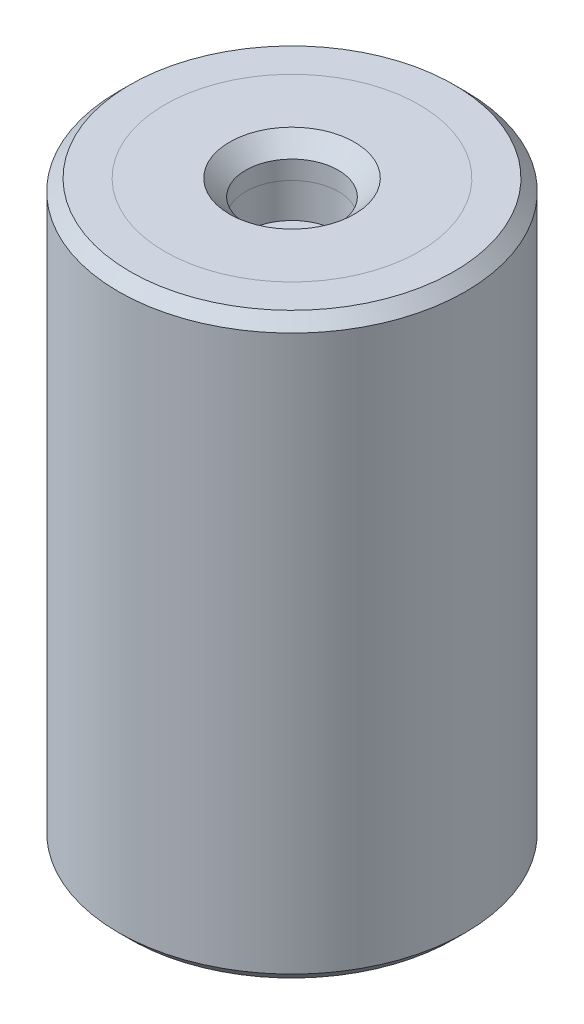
ISO-10303-21;
HEADER;
FILE_DESCRIPTION(('STEP AP214'),'2;1');
FILE_NAME('part.step','',(''),(''),'','','');
FILE_SCHEMA(('AUTOMOTIVE_DESIGN { 1 0 10303 214 1 1 1 1 }'));
ENDSEC;
DATA;
#1=APPLICATION_CONTEXT('core data for automotive mechanical design processes');
#2=APPLICATION_PROTOCOL_DEFINITION('international standard','automotive_design',2000,#1);
#3=PRODUCT_CONTEXT('',#1,'mechanical');
#4=PRODUCT('Part','Part','',(#3));
#5=PRODUCT_RELATED_PRODUCT_CATEGORY('part','',(#4));
#6=PRODUCT_DEFINITION_FORMATION('','',#4);
#7=PRODUCT_DEFINITION_CONTEXT('part definition',#1,'design');
#8=PRODUCT_DEFINITION('design','',#6,#7);
#9=PRODUCT_DEFINITION_SHAPE('','',#8);
#10=(LENGTH_UNIT() NAMED_UNIT(*) SI_UNIT(.MILLI.,.METRE.));
#11=(NAMED_UNIT(*) PLANE_ANGLE_UNIT() SI_UNIT($,.RADIAN.));
#12=(NAMED_UNIT(*) SI_UNIT($,.STERADIAN.) SOLID_ANGLE_UNIT());
#13=UNCERTAINTY_MEASURE_WITH_UNIT(LENGTH_MEASURE(1.E-05),#10,'distance_accuracy_value','');
#14=(GEOMETRIC_REPRESENTATION_CONTEXT(3) GLOBAL_UNCERTAINTY_ASSIGNED_CONTEXT((#13)) GLOBAL_UNIT_ASSIGNED_CONTEXT((#10,
#11,#12)) REPRESENTATION_CONTEXT('',''));
#15=CARTESIAN_POINT('',(0.,0.,0.));
#16=DIRECTION('',(0.,0.,1.));
#17=DIRECTION('',(1.,0.,0.));
#18=AXIS2_PLACEMENT_3D('',#15,#16,#17);
#19=CARTESIAN_POINT('',(0.,46.0340428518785,0.));
#20=DIRECTION('',(0.,1.,0.));
#21=DIRECTION('',(0.,0.,1.));
#22=AXIS2_PLACEMENT_3D('',#19,#20,#21);
#23=CYLINDRICAL_SURFACE('',#22,2.);
#24=CARTESIAN_POINT('',(0.,-22.8,0.));
#25=DIRECTION('',(0.,-1.,0.));
#26=DIRECTION('',(0.,0.,-1.));
#27=AXIS2_PLACEMENT_3D('',#24,#25,#26);
#28=CIRCLE('',#27,2.);
#29=CARTESIAN_POINT('',(0.,-22.8,-2.));
#30=VERTEX_POINT('',#29);
#31=EDGE_CURVE('P0_E10',#30,#30,#28,.T.);
#32=ORIENTED_EDGE('',*,*,#31,.T.);
#33=EDGE_LOOP('',(#32));
#34=FACE_BOUND('',#33,.T.);
#35=CARTESIAN_POINT('',(0.,-22.,0.));
#36=DIRECTION('',(0.,1.,0.));
#37=DIRECTION('',(0.,0.,1.));
#38=AXIS2_PLACEMENT_3D('',#35,#36,#37);
#39=CIRCLE('',#38,2.);
#40=CARTESIAN_POINT('',(0.,-22.,2.));
#41=VERTEX_POINT('',#40);
#42=EDGE_CURVE('P0_E25',#41,#41,#39,.T.);
#43=ORIENTED_EDGE('',*,*,#42,.T.);
#44=EDGE_LOOP('',(#43));
#45=FACE_BOUND('',#44,.T.);
#46=ADVANCED_FACE('P0_F14',(#34,#45),#23,.F.);
#47=CARTESIAN_POINT('',(0.,-22.,2.));
#48=DIRECTION('',(0.,1.,0.));
#49=DIRECTION('',(0.,0.,1.));
#50=AXIS2_PLACEMENT_3D('',#47,#48,#49);
#51=PLANE('',#50);
#52=CARTESIAN_POINT('',(0.,-22.,0.));
#53=DIRECTION('',(0.,1.,0.));
#54=DIRECTION('',(0.,0.,1.));
#55=AXIS2_PLACEMENT_3D('',#52,#53,#54);
#56=CIRCLE('',#55,5.5);
#57=CARTESIAN_POINT('',(0.,-22.,5.5));
#58=VERTEX_POINT('',#57);
#59=EDGE_CURVE('P0_E29',#58,#58,#56,.T.);
#60=ORIENTED_EDGE('',*,*,#59,.T.);
#61=EDGE_LOOP('',(#60));
#62=FACE_BOUND('',#61,.T.);
#63=ORIENTED_EDGE('',*,*,#42,.F.);
#64=EDGE_LOOP('',(#63));
#65=FACE_BOUND('',#64,.T.);
#66=ADVANCED_FACE('P0_F50',(#62,#65),#51,.T.);
#67=CARTESIAN_POINT('',(0.,46.0340428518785,0.));
#68=DIRECTION('',(0.,1.,0.));
#69=DIRECTION('',(0.,0.,1.));
#70=AXIS2_PLACEMENT_3D('',#67,#68,#69);
#71=CYLINDRICAL_SURFACE('',#70,5.5);
#72=CARTESIAN_POINT('',(0.,-23.5,0.));
#73=DIRECTION('',(0.,1.,0.));
#74=DIRECTION('',(0.,0.,1.));
#75=AXIS2_PLACEMENT_3D('',#72,#73,#74);
#76=CIRCLE('',#75,5.5);
#77=CARTESIAN_POINT('',(0.,-23.5,5.5));
#78=VERTEX_POINT('',#77);
#79=EDGE_CURVE('P0_E34',#78,#78,#76,.T.);
#80=ORIENTED_EDGE('',*,*,#79,.T.);
#81=EDGE_LOOP('',(#80));
#82=FACE_BOUND('',#81,.T.);
#83=ORIENTED_EDGE('',*,*,#59,.F.);
#84=EDGE_LOOP('',(#83));
#85=FACE_BOUND('',#84,.T.);
#86=ADVANCED_FACE('P0_F38',(#82,#85),#71,.T.);
#87=CARTESIAN_POINT('',(0.,-23.5,5.5));
#88=DIRECTION('',(0.,-1.,0.));
#89=DIRECTION('',(0.,0.,-1.));
#90=AXIS2_PLACEMENT_3D('',#87,#88,#89);
#91=PLANE('',#90);
#92=CARTESIAN_POINT('',(0.,-23.5,0.));
#93=DIRECTION('',(0.,-1.,0.));
#94=DIRECTION('',(0.,0.,-1.));
#95=AXIS2_PLACEMENT_3D('',#92,#93,#94);
#96=CIRCLE('',#95,2.7);
#97=CARTESIAN_POINT('',(0.,-23.5,-2.7));
#98=VERTEX_POINT('',#97);
#99=EDGE_CURVE('P0_E21',#98,#98,#96,.F.);
#100=ORIENTED_EDGE('',*,*,#99,.T.);
#101=EDGE_LOOP('',(#100));
#102=FACE_BOUND('',#101,.T.);
#103=ORIENTED_EDGE('',*,*,#79,.F.);
#104=EDGE_LOOP('',(#103));
#105=FACE_BOUND('',#104,.T.);
#106=ADVANCED_FACE('P0_F41',(#102,#105),#91,.T.);
#107=CARTESIAN_POINT('',(0.,-23.5,0.));
#108=DIRECTION('',(0.,-1.,0.));
#109=DIRECTION('',(0.,0.,-1.));
#110=AXIS2_PLACEMENT_3D('',#107,#108,#109);
#111=CONICAL_SURFACE('',#110,2.7,0.785398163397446);
#112=ORIENTED_EDGE('',*,*,#31,.F.);
#113=EDGE_LOOP('',(#112));
#114=FACE_BOUND('',#113,.T.);
#115=ORIENTED_EDGE('',*,*,#99,.F.);
#116=EDGE_LOOP('',(#115));
#117=FACE_BOUND('',#116,.T.);
#118=ADVANCED_FACE('P0_F16',(#114,#117),#111,.F.);
#119=CLOSED_SHELL('',(#46,#66,#86,#106,#118));
#120=MANIFOLD_SOLID_BREP('P0_B1',#119);
#121=CARTESIAN_POINT('',(0.,69.5340428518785,0.));
#122=DIRECTION('',(0.,1.,0.));
#123=DIRECTION('',(0.,0.,1.));
#124=AXIS2_PLACEMENT_3D('',#121,#122,#123);
#125=CYLINDRICAL_SURFACE('',#124,2.);
#126=CARTESIAN_POINT('',(0.,0.800000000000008,0.));
#127=DIRECTION('',(0.,1.,0.));
#128=DIRECTION('',(0.,0.,1.));
#129=AXIS2_PLACEMENT_3D('',#126,#127,#128);
#130=CIRCLE('',#129,2.);
#131=CARTESIAN_POINT('',(0.,0.800000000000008,2.));
#132=VERTEX_POINT('',#131);
#133=EDGE_CURVE('P1_E21',#132,#132,#130,.T.);
#134=ORIENTED_EDGE('',*,*,#133,.T.);
#135=EDGE_LOOP('',(#134));
#136=FACE_BOUND('',#135,.T.);
#137=CARTESIAN_POINT('',(0.,0.,0.));
#138=DIRECTION('',(0.,1.,0.));
#139=DIRECTION('',(0.,0.,1.));
#140=AXIS2_PLACEMENT_3D('',#137,#138,#139);
#141=CIRCLE('',#140,2.);
#142=CARTESIAN_POINT('',(0.,0.,2.));
#143=VERTEX_POINT('',#142);
#144=EDGE_CURVE('P1_E34',#143,#143,#141,.T.);
#145=ORIENTED_EDGE('',*,*,#144,.F.);
#146=EDGE_LOOP('',(#145));
#147=FACE_BOUND('',#146,.T.);
#148=ADVANCED_FACE('P1_F14',(#136,#147),#125,.F.);
#149=CARTESIAN_POINT('',(0.,1.5,2.));
#150=DIRECTION('',(0.,1.,0.));
#151=DIRECTION('',(0.,0.,1.));
#152=AXIS2_PLACEMENT_3D('',#149,#150,#151);
#153=PLANE('',#152);
#154=CARTESIAN_POINT('',(0.,1.5,0.));
#155=DIRECTION('',(0.,1.,0.));
#156=DIRECTION('',(0.,0.,1.));
#157=AXIS2_PLACEMENT_3D('',#154,#155,#156);
#158=CIRCLE('',#157,2.7);
#159=CARTESIAN_POINT('',(0.,1.5,2.7));
#160=VERTEX_POINT('',#159);
#161=EDGE_CURVE('P1_E10',#160,#160,#158,.F.);
#162=ORIENTED_EDGE('',*,*,#161,.T.);
#163=EDGE_LOOP('',(#162));
#164=FACE_BOUND('',#163,.T.);
#165=CARTESIAN_POINT('',(0.,1.5,0.));
#166=DIRECTION('',(0.,1.,0.));
#167=DIRECTION('',(0.,0.,1.));
#168=AXIS2_PLACEMENT_3D('',#165,#166,#167);
#169=CIRCLE('',#168,5.5);
#170=CARTESIAN_POINT('',(0.,1.5,5.5));
#171=VERTEX_POINT('',#170);
#172=EDGE_CURVE('P1_E25',#171,#171,#169,.T.);
#173=ORIENTED_EDGE('',*,*,#172,.T.);
#174=EDGE_LOOP('',(#173));
#175=FACE_BOUND('',#174,.T.);
#176=ADVANCED_FACE('P1_F42',(#164,#175),#153,.T.);
#177=CARTESIAN_POINT('',(0.,69.5340428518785,0.));
#178=DIRECTION('',(0.,1.,0.));
#179=DIRECTION('',(0.,0.,1.));
#180=AXIS2_PLACEMENT_3D('',#177,#178,#179);
#181=CYLINDRICAL_SURFACE('',#180,5.5);
#182=CARTESIAN_POINT('',(0.,0.,0.));
#183=DIRECTION('',(0.,1.,0.));
#184=DIRECTION('',(0.,0.,1.));
#185=AXIS2_PLACEMENT_3D('',#182,#183,#184);
#186=CIRCLE('',#185,5.5);
#187=CARTESIAN_POINT('',(0.,0.,5.5));
#188=VERTEX_POINT('',#187);
#189=EDGE_CURVE('P1_E29',#188,#188,#186,.T.);
#190=ORIENTED_EDGE('',*,*,#189,.T.);
#191=EDGE_LOOP('',(#190));
#192=FACE_BOUND('',#191,.T.);
#193=ORIENTED_EDGE('',*,*,#172,.F.);
#194=EDGE_LOOP('',(#193));
#195=FACE_BOUND('',#194,.T.);
#196=ADVANCED_FACE('P1_F47',(#192,#195),#181,.T.);
#197=CARTESIAN_POINT('',(0.,0.,5.5));
#198=DIRECTION('',(0.,-1.,0.));
#199=DIRECTION('',(0.,0.,-1.));
#200=AXIS2_PLACEMENT_3D('',#197,#198,#199);
#201=PLANE('',#200);
#202=ORIENTED_EDGE('',*,*,#144,.T.);
#203=EDGE_LOOP('',(#202));
#204=FACE_BOUND('',#203,.T.);
#205=ORIENTED_EDGE('',*,*,#189,.F.);
#206=EDGE_LOOP('',(#205));
#207=FACE_BOUND('',#206,.T.);
#208=ADVANCED_FACE('P1_F38',(#204,#207),#201,.T.);
#209=CARTESIAN_POINT('',(0.,0.800000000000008,0.));
#210=DIRECTION('',(0.,1.,0.));
#211=DIRECTION('',(0.,0.,1.));
#212=AXIS2_PLACEMENT_3D('',#209,#210,#211);
#213=CONICAL_SURFACE('',#212,2.,0.785398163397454);
#214=ORIENTED_EDGE('',*,*,#161,.F.);
#215=EDGE_LOOP('',(#214));
#216=FACE_BOUND('',#215,.T.);
#217=ORIENTED_EDGE('',*,*,#133,.F.);
#218=EDGE_LOOP('',(#217));
#219=FACE_BOUND('',#218,.T.);
#220=ADVANCED_FACE('P1_F16',(#216,#219),#213,.F.);
#221=CLOSED_SHELL('',(#148,#176,#196,#208,#220));
#222=MANIFOLD_SOLID_BREP('P1_B1',#221);
#223=CARTESIAN_POINT('',(0.,0.,0.));
#224=DIRECTION('',(0.,1.,0.));
#225=DIRECTION('',(0.,0.,1.));
#226=AXIS2_PLACEMENT_3D('',#223,#224,#225);
#227=PLANE('',#226);
#228=CARTESIAN_POINT('',(0.,0.,0.));
#229=DIRECTION('',(0.,1.,0.));
#230=DIRECTION('',(0.,0.,1.));
#231=AXIS2_PLACEMENT_3D('',#228,#229,#230);
#232=CIRCLE('',#231,2.);
#233=CARTESIAN_POINT('',(0.,0.,2.));
#234=VERTEX_POINT('',#233);
#235=EDGE_CURVE('P2_E46',#234,#234,#232,.T.);
#236=ORIENTED_EDGE('',*,*,#235,.F.);
#237=EDGE_LOOP('',(#236));
#238=FACE_BOUND('',#237,.T.);
#239=CARTESIAN_POINT('',(0.,0.,0.));
#240=DIRECTION('',(0.,1.,0.));
#241=DIRECTION('',(0.,0.,1.));
#242=AXIS2_PLACEMENT_3D('',#239,#240,#241);
#243=CIRCLE('',#242,5.5);
#244=CARTESIAN_POINT('',(0.,0.,5.5));
#245=VERTEX_POINT('',#244);
#246=EDGE_CURVE('P2_E33',#245,#245,#243,.T.);
#247=ORIENTED_EDGE('',*,*,#246,.T.);
#248=EDGE_LOOP('',(#247));
#249=FACE_BOUND('',#248,.T.);
#250=ADVANCED_FACE('P2_F13',(#238,#249),#227,.T.);
#251=CARTESIAN_POINT('',(0.,65.5134936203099,0.));
#252=DIRECTION('',(0.,1.,0.));
#253=DIRECTION('',(0.,0.,1.));
#254=AXIS2_PLACEMENT_3D('',#251,#252,#253);
#255=CYLINDRICAL_SURFACE('',#254,5.5);
#256=CARTESIAN_POINT('',(0.,1.5,0.));
#257=DIRECTION('',(0.,1.,0.));
#258=DIRECTION('',(0.,0.,1.));
#259=AXIS2_PLACEMENT_3D('',#256,#257,#258);
#260=CIRCLE('',#259,5.5);
#261=CARTESIAN_POINT('',(0.,1.5,5.5));
#262=VERTEX_POINT('',#261);
#263=EDGE_CURVE('P2_E36',#262,#262,#260,.T.);
#264=ORIENTED_EDGE('',*,*,#263,.T.);
#265=EDGE_LOOP('',(#264));
#266=FACE_BOUND('',#265,.T.);
#267=ORIENTED_EDGE('',*,*,#246,.F.);
#268=EDGE_LOOP('',(#267));
#269=FACE_BOUND('',#268,.T.);
#270=ADVANCED_FACE('P2_F92',(#266,#269),#255,.F.);
#271=CARTESIAN_POINT('',(0.,1.5,5.5));
#272=DIRECTION('',(0.,1.,0.));
#273=DIRECTION('',(0.,0.,1.));
#274=AXIS2_PLACEMENT_3D('',#271,#272,#273);
#275=PLANE('',#274);
#276=CARTESIAN_POINT('',(0.,1.5,0.));
#277=DIRECTION('',(0.,1.,0.));
#278=DIRECTION('',(0.,0.,1.));
#279=AXIS2_PLACEMENT_3D('',#276,#277,#278);
#280=CIRCLE('',#279,7.);
#281=CARTESIAN_POINT('',(0.,1.5,7.));
#282=VERTEX_POINT('',#281);
#283=EDGE_CURVE('P2_E9',#282,#282,#280,.T.);
#284=ORIENTED_EDGE('',*,*,#283,.T.);
#285=EDGE_LOOP('',(#284));
#286=FACE_BOUND('',#285,.T.);
#287=ORIENTED_EDGE('',*,*,#263,.F.);
#288=EDGE_LOOP('',(#287));
#289=FACE_BOUND('',#288,.T.);
#290=ADVANCED_FACE('P2_F88',(#286,#289),#275,.T.);
#291=CARTESIAN_POINT('',(0.,65.5134936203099,0.));
#292=DIRECTION('',(0.,1.,0.));
#293=DIRECTION('',(0.,0.,1.));
#294=AXIS2_PLACEMENT_3D('',#291,#292,#293);
#295=CYLINDRICAL_SURFACE('',#294,7.5);
#296=CARTESIAN_POINT('',(0.,-23.,0.));
#297=DIRECTION('',(0.,-1.,0.));
#298=DIRECTION('',(0.,0.,-1.));
#299=AXIS2_PLACEMENT_3D('',#296,#297,#298);
#300=CIRCLE('',#299,7.5);
#301=CARTESIAN_POINT('',(0.,-23.,-7.5));
#302=VERTEX_POINT('',#301);
#303=EDGE_CURVE('P2_E24',#302,#302,#300,.F.);
#304=ORIENTED_EDGE('',*,*,#303,.T.);
#305=EDGE_LOOP('',(#304));
#306=FACE_BOUND('',#305,.T.);
#307=CARTESIAN_POINT('',(0.,1.,0.));
#308=DIRECTION('',(0.,1.,0.));
#309=DIRECTION('',(0.,0.,1.));
#310=AXIS2_PLACEMENT_3D('',#307,#308,#309);
#311=CIRCLE('',#310,7.5);
#312=CARTESIAN_POINT('',(0.,1.,7.5));
#313=VERTEX_POINT('',#312);
#314=EDGE_CURVE('P2_E28',#313,#313,#311,.F.);
#315=ORIENTED_EDGE('',*,*,#314,.T.);
#316=EDGE_LOOP('',(#315));
#317=FACE_BOUND('',#316,.T.);
#318=ADVANCED_FACE('P2_F82',(#306,#317),#295,.T.);
#319=CARTESIAN_POINT('',(0.,-23.5,7.5));
#320=DIRECTION('',(0.,-1.,0.));
#321=DIRECTION('',(0.,0.,-1.));
#322=AXIS2_PLACEMENT_3D('',#319,#320,#321);
#323=PLANE('',#322);
#324=CARTESIAN_POINT('',(0.,-23.5,0.));
#325=DIRECTION('',(0.,-1.,0.));
#326=DIRECTION('',(0.,0.,-1.));
#327=AXIS2_PLACEMENT_3D('',#324,#325,#326);
#328=CIRCLE('',#327,6.99999999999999);
#329=CARTESIAN_POINT('',(0.,-23.5,-6.99999999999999));
#330=VERTEX_POINT('',#329);
#331=EDGE_CURVE('P2_E20',#330,#330,#328,.T.);
#332=ORIENTED_EDGE('',*,*,#331,.T.);
#333=EDGE_LOOP('',(#332));
#334=FACE_BOUND('',#333,.T.);
#335=CARTESIAN_POINT('',(0.,-23.5,0.));
#336=DIRECTION('',(0.,1.,0.));
#337=DIRECTION('',(0.,0.,1.));
#338=AXIS2_PLACEMENT_3D('',#335,#336,#337);
#339=CIRCLE('',#338,5.49999999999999);
#340=CARTESIAN_POINT('',(0.,-23.5,5.49999999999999));
#341=VERTEX_POINT('',#340);
#342=EDGE_CURVE('P2_E39',#341,#341,#339,.T.);
#343=ORIENTED_EDGE('',*,*,#342,.T.);
#344=EDGE_LOOP('',(#343));
#345=FACE_BOUND('',#344,.T.);
#346=ADVANCED_FACE('P2_F77',(#334,#345),#323,.T.);
#347=CARTESIAN_POINT('',(0.,65.5134936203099,0.));
#348=DIRECTION('',(0.,1.,0.));
#349=DIRECTION('',(0.,0.,1.));
#350=AXIS2_PLACEMENT_3D('',#347,#348,#349);
#351=CYLINDRICAL_SURFACE('',#350,5.49999999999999);
#352=CARTESIAN_POINT('',(0.,-22.,0.));
#353=DIRECTION('',(0.,1.,0.));
#354=DIRECTION('',(0.,0.,1.));
#355=AXIS2_PLACEMENT_3D('',#352,#353,#354);
#356=CIRCLE('',#355,5.49999999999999);
#357=CARTESIAN_POINT('',(0.,-22.,5.49999999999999));
#358=VERTEX_POINT('',#357);
#359=EDGE_CURVE('P2_E42',#358,#358,#356,.T.);
#360=ORIENTED_EDGE('',*,*,#359,.T.);
#361=EDGE_LOOP('',(#360));
#362=FACE_BOUND('',#361,.T.);
#363=ORIENTED_EDGE('',*,*,#342,.F.);
#364=EDGE_LOOP('',(#363));
#365=FACE_BOUND('',#364,.T.);
#366=ADVANCED_FACE('P2_F71',(#362,#365),#351,.F.);
#367=CARTESIAN_POINT('',(0.,-22.,5.49999999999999));
#368=DIRECTION('',(0.,-1.,0.));
#369=DIRECTION('',(0.,0.,-1.));
#370=AXIS2_PLACEMENT_3D('',#367,#368,#369);
#371=PLANE('',#370);
#372=CARTESIAN_POINT('',(0.,-22.,0.));
#373=DIRECTION('',(0.,-1.,0.));
#374=DIRECTION('',(0.,0.,-1.));
#375=AXIS2_PLACEMENT_3D('',#372,#373,#374);
#376=CIRCLE('',#375,2.);
#377=CARTESIAN_POINT('',(0.,-22.,-2.));
#378=VERTEX_POINT('',#377);
#379=EDGE_CURVE('P2_E52',#378,#378,#376,.T.);
#380=ORIENTED_EDGE('',*,*,#379,.F.);
#381=EDGE_LOOP('',(#380));
#382=FACE_BOUND('',#381,.T.);
#383=ORIENTED_EDGE('',*,*,#359,.F.);
#384=EDGE_LOOP('',(#383));
#385=FACE_BOUND('',#384,.T.);
#386=ADVANCED_FACE('P2_F67',(#382,#385),#371,.T.);
#387=CARTESIAN_POINT('',(0.,-23.,0.));
#388=DIRECTION('',(0.,1.,0.));
#389=DIRECTION('',(0.,0.,1.));
#390=AXIS2_PLACEMENT_3D('',#387,#388,#389);
#391=CONICAL_SURFACE('',#390,7.5,0.785398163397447);
#392=ORIENTED_EDGE('',*,*,#331,.F.);
#393=EDGE_LOOP('',(#392));
#394=FACE_BOUND('',#393,.T.);
#395=ORIENTED_EDGE('',*,*,#303,.F.);
#396=EDGE_LOOP('',(#395));
#397=FACE_BOUND('',#396,.T.);
#398=ADVANCED_FACE('P2_F70',(#394,#397),#391,.T.);
#399=CARTESIAN_POINT('',(0.,1.5,0.));
#400=DIRECTION('',(0.,-1.,0.));
#401=DIRECTION('',(0.,0.,-1.));
#402=AXIS2_PLACEMENT_3D('',#399,#400,#401);
#403=CONICAL_SURFACE('',#402,7.,0.785398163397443);
#404=ORIENTED_EDGE('',*,*,#314,.F.);
#405=EDGE_LOOP('',(#404));
#406=FACE_BOUND('',#405,.T.);
#407=ORIENTED_EDGE('',*,*,#283,.F.);
#408=EDGE_LOOP('',(#407));
#409=FACE_BOUND('',#408,.T.);
#410=ADVANCED_FACE('P2_F15',(#406,#409),#403,.T.);
#411=CARTESIAN_POINT('',(0.,-1.5,0.));
#412=DIRECTION('',(0.,1.,0.));
#413=DIRECTION('',(0.,0.,1.));
#414=AXIS2_PLACEMENT_3D('',#411,#412,#413);
#415=CYLINDRICAL_SURFACE('',#414,2.);
#416=CARTESIAN_POINT('',(0.,-1.5,0.));
#417=DIRECTION('',(0.,1.,0.));
#418=DIRECTION('',(0.,0.,1.));
#419=AXIS2_PLACEMENT_3D('',#416,#417,#418);
#420=CIRCLE('',#419,2.);
#421=CARTESIAN_POINT('',(0.,-1.5,2.));
#422=VERTEX_POINT('',#421);
#423=EDGE_CURVE('P2_E45',#422,#422,#420,.T.);
#424=ORIENTED_EDGE('',*,*,#423,.F.);
#425=EDGE_LOOP('',(#424));
#426=FACE_BOUND('',#425,.T.);
#427=ORIENTED_EDGE('',*,*,#235,.T.);
#428=EDGE_LOOP('',(#427));
#429=FACE_BOUND('',#428,.T.);
#430=ADVANCED_FACE('P2_F108',(#426,#429),#415,.F.);
#431=CARTESIAN_POINT('',(0.,-1.5,0.));
#432=DIRECTION('',(0.,1.,0.));
#433=DIRECTION('',(0.,0.,1.));
#434=AXIS2_PLACEMENT_3D('',#431,#432,#433);
#435=PLANE('',#434);
#436=ORIENTED_EDGE('',*,*,#423,.T.);
#437=EDGE_LOOP('',(#436));
#438=FACE_BOUND('',#437,.T.);
#439=ADVANCED_FACE('P2_F63',(#438),#435,.T.);
#440=CARTESIAN_POINT('',(0.,-20.5,0.));
#441=DIRECTION('',(0.,-1.,0.));
#442=DIRECTION('',(0.,0.,-1.));
#443=AXIS2_PLACEMENT_3D('',#440,#441,#442);
#444=CYLINDRICAL_SURFACE('',#443,2.);
#445=CARTESIAN_POINT('',(0.,-20.5,0.));
#446=DIRECTION('',(0.,-1.,0.));
#447=DIRECTION('',(0.,0.,-1.));
#448=AXIS2_PLACEMENT_3D('',#445,#446,#447);
#449=CIRCLE('',#448,2.);
#450=CARTESIAN_POINT('',(0.,-20.5,-2.));
#451=VERTEX_POINT('',#450);
#452=EDGE_CURVE('P2_E49',#451,#451,#449,.T.);
#453=ORIENTED_EDGE('',*,*,#452,.F.);
#454=EDGE_LOOP('',(#453));
#455=FACE_BOUND('',#454,.T.);
#456=ORIENTED_EDGE('',*,*,#379,.T.);
#457=EDGE_LOOP('',(#456));
#458=FACE_BOUND('',#457,.T.);
#459=ADVANCED_FACE('P2_F60',(#455,#458),#444,.F.);
#460=CARTESIAN_POINT('',(0.,-20.5,0.));
#461=DIRECTION('',(0.,-1.,0.));
#462=DIRECTION('',(0.,0.,-1.));
#463=AXIS2_PLACEMENT_3D('',#460,#461,#462);
#464=PLANE('',#463);
#465=ORIENTED_EDGE('',*,*,#452,.T.);
#466=EDGE_LOOP('',(#465));
#467=FACE_BOUND('',#466,.T.);
#468=ADVANCED_FACE('P2_F58',(#467),#464,.T.);
#469=CLOSED_SHELL('',(#250,#270,#290,#318,#346,#366,#386,#398,#410,#430,#439,#459,#468));
#470=MANIFOLD_SOLID_BREP('P2_B1',#469);
#471=ADVANCED_BREP_SHAPE_REPRESENTATION('',(#18,#120,#222,#470),#14);
#472=SHAPE_DEFINITION_REPRESENTATION(#9,#471);
ENDSEC;
END-ISO-10303-21;
